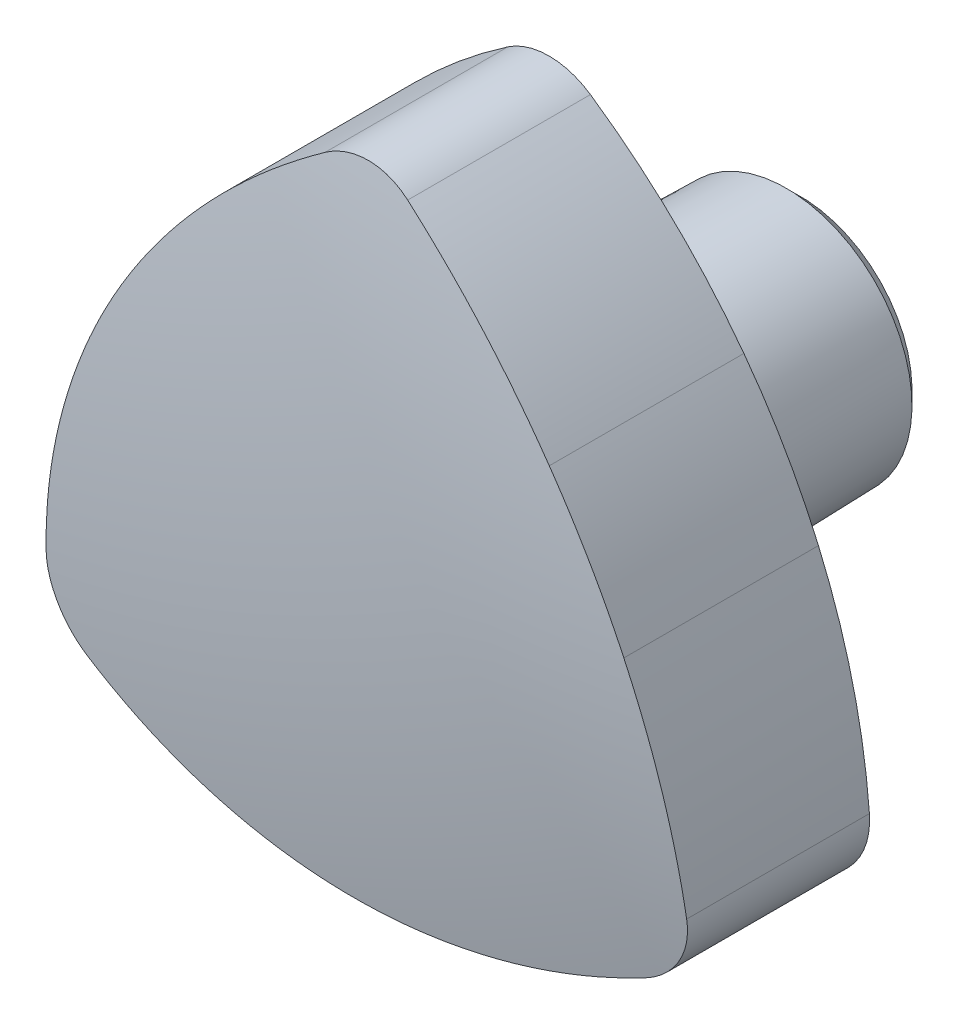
ISO-10303-21;
HEADER;
FILE_DESCRIPTION(('STEP AP214'),'2;1');
FILE_NAME('part.step','',(''),(''),'','','');
FILE_SCHEMA(('AUTOMOTIVE_DESIGN { 1 0 10303 214 1 1 1 1 }'));
ENDSEC;
DATA;
#1=APPLICATION_CONTEXT('core data for automotive mechanical design processes');
#2=APPLICATION_PROTOCOL_DEFINITION('international standard','automotive_design',2000,#1);
#3=PRODUCT_CONTEXT('',#1,'mechanical');
#4=PRODUCT('Part','Part','',(#3));
#5=PRODUCT_RELATED_PRODUCT_CATEGORY('part','',(#4));
#6=PRODUCT_DEFINITION_FORMATION('','',#4);
#7=PRODUCT_DEFINITION_CONTEXT('part definition',#1,'design');
#8=PRODUCT_DEFINITION('design','',#6,#7);
#9=PRODUCT_DEFINITION_SHAPE('','',#8);
#10=(LENGTH_UNIT() NAMED_UNIT(*) SI_UNIT(.MILLI.,.METRE.));
#11=(NAMED_UNIT(*) PLANE_ANGLE_UNIT() SI_UNIT($,.RADIAN.));
#12=(NAMED_UNIT(*) SI_UNIT($,.STERADIAN.) SOLID_ANGLE_UNIT());
#13=UNCERTAINTY_MEASURE_WITH_UNIT(LENGTH_MEASURE(1.E-05),#10,'distance_accuracy_value','');
#14=(GEOMETRIC_REPRESENTATION_CONTEXT(3) GLOBAL_UNCERTAINTY_ASSIGNED_CONTEXT((#13)) GLOBAL_UNIT_ASSIGNED_CONTEXT((#10,
#11,#12)) REPRESENTATION_CONTEXT('',''));
#15=CARTESIAN_POINT('',(0.,0.,0.));
#16=DIRECTION('',(0.,0.,1.));
#17=DIRECTION('',(1.,0.,0.));
#18=AXIS2_PLACEMENT_3D('',#15,#16,#17);
#19=CARTESIAN_POINT('',(3.,0.,12.));
#20=DIRECTION('',(0.,0.,1.));
#21=DIRECTION('',(0.,-1.,0.));
#22=AXIS2_PLACEMENT_3D('',#19,#20,#21);
#23=PLANE('',#22);
#24=CARTESIAN_POINT('',(0.,0.,12.));
#25=DIRECTION('',(0.,0.,1.));
#26=DIRECTION('',(0.,-1.,0.));
#27=AXIS2_PLACEMENT_3D('',#24,#25,#26);
#28=CIRCLE('',#27,3.);
#29=CARTESIAN_POINT('',(0.,-3.,12.));
#30=VERTEX_POINT('',#29);
#31=EDGE_CURVE('E110',#30,#30,#28,.T.);
#32=ORIENTED_EDGE('',*,*,#31,.F.);
#33=EDGE_LOOP('',(#32));
#34=FACE_BOUND('',#33,.T.);
#35=ADVANCED_FACE('F14',(#34),#23,.F.);
#36=CARTESIAN_POINT('',(0.,0.,33.0948745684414));
#37=DIRECTION('',(0.,0.,1.));
#38=DIRECTION('',(0.,-1.,0.));
#39=AXIS2_PLACEMENT_3D('',#36,#37,#38);
#40=CYLINDRICAL_SURFACE('',#39,3.);
#41=CARTESIAN_POINT('',(0.,0.,0.));
#42=DIRECTION('',(0.,0.,1.));
#43=DIRECTION('',(0.,-1.,0.));
#44=AXIS2_PLACEMENT_3D('',#41,#42,#43);
#45=CIRCLE('',#44,3.);
#46=CARTESIAN_POINT('',(0.,-3.,0.));
#47=VERTEX_POINT('',#46);
#48=EDGE_CURVE('E264',#47,#47,#45,.T.);
#49=ORIENTED_EDGE('',*,*,#48,.F.);
#50=EDGE_LOOP('',(#49));
#51=FACE_BOUND('',#50,.T.);
#52=ORIENTED_EDGE('',*,*,#31,.T.);
#53=EDGE_LOOP('',(#52));
#54=FACE_BOUND('',#53,.T.);
#55=ADVANCED_FACE('F253',(#51,#54),#40,.F.);
#56=CARTESIAN_POINT('',(6.2298324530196,0.,0.));
#57=DIRECTION('',(0.,0.,1.));
#58=DIRECTION('',(0.,-1.,0.));
#59=AXIS2_PLACEMENT_3D('',#56,#57,#58);
#60=PLANE('',#59);
#61=CARTESIAN_POINT('',(0.,0.,0.));
#62=DIRECTION('',(0.,0.,1.));
#63=DIRECTION('',(0.,-1.,0.));
#64=AXIS2_PLACEMENT_3D('',#61,#62,#63);
#65=CIRCLE('',#64,6.2298324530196);
#66=CARTESIAN_POINT('',(0.,-6.2298324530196,0.));
#67=VERTEX_POINT('',#66);
#68=EDGE_CURVE('E266',#67,#67,#65,.T.);
#69=ORIENTED_EDGE('',*,*,#68,.F.);
#70=EDGE_LOOP('',(#69));
#71=FACE_BOUND('',#70,.T.);
#72=ORIENTED_EDGE('',*,*,#48,.T.);
#73=EDGE_LOOP('',(#72));
#74=FACE_BOUND('',#73,.T.);
#75=ADVANCED_FACE('F259',(#71,#74),#60,.F.);
#76=CARTESIAN_POINT('',(0.,0.,0.));
#77=DIRECTION('',(0.,0.,1.));
#78=DIRECTION('',(0.,-1.,0.));
#79=AXIS2_PLACEMENT_3D('',#76,#77,#78);
#80=CONICAL_SURFACE('',#79,6.2298324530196,0.785398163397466);
#81=CARTESIAN_POINT('',(0.,0.,0.770167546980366));
#82=DIRECTION('',(0.,0.,1.));
#83=DIRECTION('',(0.,-1.,0.));
#84=AXIS2_PLACEMENT_3D('',#81,#82,#83);
#85=CIRCLE('',#84,7.);
#86=CARTESIAN_POINT('',(0.,-7.,0.770167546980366));
#87=VERTEX_POINT('',#86);
#88=EDGE_CURVE('E271',#87,#87,#85,.T.);
#89=ORIENTED_EDGE('',*,*,#88,.F.);
#90=EDGE_LOOP('',(#89));
#91=FACE_BOUND('',#90,.T.);
#92=ORIENTED_EDGE('',*,*,#68,.T.);
#93=EDGE_LOOP('',(#92));
#94=FACE_BOUND('',#93,.T.);
#95=ADVANCED_FACE('F436',(#91,#94),#80,.T.);
#96=CARTESIAN_POINT('',(0.,0.,0.770167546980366));
#97=DIRECTION('',(0.,0.,1.));
#98=DIRECTION('',(0.,-1.,0.));
#99=AXIS2_PLACEMENT_3D('',#96,#97,#98);
#100=CONICAL_SURFACE('',#99,7.,0.0261799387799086);
#101=CARTESIAN_POINT('',(0.,0.,11.1471451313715));
#102=DIRECTION('',(0.,0.,1.));
#103=DIRECTION('',(0.,-1.,0.));
#104=AXIS2_PLACEMENT_3D('',#101,#102,#103);
#105=CIRCLE('',#104,7.27173072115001);
#106=CARTESIAN_POINT('',(0.,-7.27173072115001,11.1471451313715));
#107=VERTEX_POINT('',#106);
#108=EDGE_CURVE('E274',#107,#107,#105,.T.);
#109=ORIENTED_EDGE('',*,*,#108,.F.);
#110=EDGE_LOOP('',(#109));
#111=FACE_BOUND('',#110,.T.);
#112=ORIENTED_EDGE('',*,*,#88,.T.);
#113=EDGE_LOOP('',(#112));
#114=FACE_BOUND('',#113,.T.);
#115=ADVANCED_FACE('F426',(#111,#114),#100,.T.);
#116=CARTESIAN_POINT('',(0.,0.,11.0882469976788));
#117=DIRECTION('',(0.,0.,1.));
#118=DIRECTION('',(0.,-1.,0.));
#119=AXIS2_PLACEMENT_3D('',#116,#117,#118);
#120=TOROIDAL_SURFACE('',#119,9.52095970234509,2.25000000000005);
#121=CARTESIAN_POINT('',(0.,0.,13.3189979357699));
#122=DIRECTION('',(0.,0.,1.));
#123=DIRECTION('',(0.,-1.,0.));
#124=AXIS2_PLACEMENT_3D('',#121,#122,#123);
#125=CIRCLE('',#124,9.22727576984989);
#126=CARTESIAN_POINT('',(0.,-9.22727576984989,13.3189979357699));
#127=VERTEX_POINT('',#126);
#128=EDGE_CURVE('E277',#127,#127,#125,.T.);
#129=ORIENTED_EDGE('',*,*,#128,.F.);
#130=EDGE_LOOP('',(#129));
#131=FACE_BOUND('',#130,.T.);
#132=ORIENTED_EDGE('',*,*,#108,.T.);
#133=EDGE_LOOP('',(#132));
#134=FACE_BOUND('',#133,.T.);
#135=ADVANCED_FACE('F415',(#131,#134),#120,.F.);
#136=CARTESIAN_POINT('',(0.,0.,13.3189979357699));
#137=DIRECTION('',(0.,0.,1.));
#138=DIRECTION('',(0.,-1.,0.));
#139=AXIS2_PLACEMENT_3D('',#136,#137,#138);
#140=CONICAL_SURFACE('',#139,9.22727576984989,1.43989663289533);
#141=CARTESIAN_POINT('',(0.,0.,14.));
#142=DIRECTION('',(0.,0.,1.));
#143=DIRECTION('',(0.,-1.,0.));
#144=AXIS2_PLACEMENT_3D('',#141,#142,#143);
#145=CIRCLE('',#144,14.4);
#146=CARTESIAN_POINT('',(0.,-14.4,14.));
#147=VERTEX_POINT('',#146);
#148=EDGE_CURVE('E280',#147,#147,#145,.T.);
#149=ORIENTED_EDGE('',*,*,#148,.F.);
#150=EDGE_LOOP('',(#149));
#151=FACE_BOUND('',#150,.T.);
#152=ORIENTED_EDGE('',*,*,#128,.T.);
#153=EDGE_LOOP('',(#152));
#154=FACE_BOUND('',#153,.T.);
#155=ADVANCED_FACE('F249',(#151,#154),#140,.T.);
#156=CARTESIAN_POINT('',(14.4,0.,14.));
#157=DIRECTION('',(0.,0.,1.));
#158=DIRECTION('',(0.,-1.,0.));
#159=AXIS2_PLACEMENT_3D('',#156,#157,#158);
#160=PLANE('',#159);
#161=CARTESIAN_POINT('',(17.9664252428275,-10.3729204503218,14.));
#162=DIRECTION('',(0.,0.,1.));
#163=DIRECTION('',(0.,-1.,0.));
#164=AXIS2_PLACEMENT_3D('',#161,#162,#163);
#165=CIRCLE('',#164,35.925661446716);
#166=CARTESIAN_POINT('',(-10.8589068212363,11.0689400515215,14.));
#167=VERTEX_POINT('',#166);
#168=CARTESIAN_POINT('',(-2.30380891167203,19.2880093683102,14.));
#169=VERTEX_POINT('',#168);
#170=EDGE_CURVE('E286',#167,#169,#165,.F.);
#171=ORIENTED_EDGE('',*,*,#170,.T.);
#172=CARTESIAN_POINT('',(0.,15.9168510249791,14.));
#173=DIRECTION('',(0.,0.,1.));
#174=DIRECTION('',(0.,-1.,0.));
#175=AXIS2_PLACEMENT_3D('',#172,#173,#174);
#176=CIRCLE('',#175,4.08316593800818);
#177=CARTESIAN_POINT('',(2.30380891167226,19.28800936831,14.));
#178=VERTEX_POINT('',#177);
#179=EDGE_CURVE('E283',#169,#178,#176,.F.);
#180=ORIENTED_EDGE('',*,*,#179,.T.);
#181=CARTESIAN_POINT('',(-17.9664252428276,-10.3729204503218,14.));
#182=DIRECTION('',(0.,0.,1.));
#183=DIRECTION('',(0.,-1.,0.));
#184=AXIS2_PLACEMENT_3D('',#181,#182,#183);
#185=CIRCLE('',#184,35.925661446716);
#186=CARTESIAN_POINT('',(10.8589068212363,11.0689400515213,14.));
#187=VERTEX_POINT('',#186);
#188=EDGE_CURVE('E314',#178,#187,#185,.F.);
#189=ORIENTED_EDGE('',*,*,#188,.T.);
#190=CARTESIAN_POINT('',(-17.888591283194,-10.3279829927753,14.));
#191=DIRECTION('',(0.,0.,1.));
#192=DIRECTION('',(0.,-1.,0.));
#193=AXIS2_PLACEMENT_3D('',#190,#191,#192);
#194=CIRCLE('',#193,35.8363916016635);
#195=CARTESIAN_POINT('',(15.0154366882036,3.86961913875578,14.));
#196=VERTEX_POINT('',#195);
#197=EDGE_CURVE('E117',#187,#196,#194,.F.);
#198=ORIENTED_EDGE('',*,*,#197,.T.);
#199=CARTESIAN_POINT('',(-17.9664252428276,-10.3729204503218,14.));
#200=DIRECTION('',(0.,0.,1.));
#201=DIRECTION('',(0.,-1.,0.));
#202=AXIS2_PLACEMENT_3D('',#199,#200,#201);
#203=CIRCLE('',#202,35.925661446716);
#204=CARTESIAN_POINT('',(17.8558105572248,-7.64884764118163,14.));
#205=VERTEX_POINT('',#204);
#206=EDGE_CURVE('E310',#196,#205,#203,.F.);
#207=ORIENTED_EDGE('',*,*,#206,.T.);
#208=CARTESIAN_POINT('',(13.7843973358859,-7.9584255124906,14.));
#209=DIRECTION('',(0.,0.,1.));
#210=DIRECTION('',(0.,-1.,0.));
#211=AXIS2_PLACEMENT_3D('',#208,#209,#210);
#212=CIRCLE('',#211,4.08316593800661);
#213=CARTESIAN_POINT('',(15.5520016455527,-11.6391617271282,14.));
#214=VERTEX_POINT('',#213);
#215=EDGE_CURVE('E307',#205,#214,#212,.F.);
#216=ORIENTED_EDGE('',*,*,#215,.T.);
#217=CARTESIAN_POINT('',(0.,20.7458409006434,14.));
#218=DIRECTION('',(0.,0.,1.));
#219=DIRECTION('',(0.,-1.,0.));
#220=AXIS2_PLACEMENT_3D('',#217,#218,#219);
#221=CIRCLE('',#220,35.9256614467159);
#222=CARTESIAN_POINT('',(4.15652986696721,-14.9385591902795,14.));
#223=VERTEX_POINT('',#222);
#224=EDGE_CURVE('E304',#214,#223,#221,.F.);
#225=ORIENTED_EDGE('',*,*,#224,.T.);
#226=CARTESIAN_POINT('',(0.,20.6559659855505,14.));
#227=DIRECTION('',(0.,0.,1.));
#228=DIRECTION('',(0.,-1.,0.));
#229=AXIS2_PLACEMENT_3D('',#226,#227,#228);
#230=CIRCLE('',#229,35.8363916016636);
#231=CARTESIAN_POINT('',(-4.15652986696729,-14.9385591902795,14.));
#232=VERTEX_POINT('',#231);
#233=EDGE_CURVE('E301',#223,#232,#230,.F.);
#234=ORIENTED_EDGE('',*,*,#233,.T.);
#235=CARTESIAN_POINT('',(0.,20.7458409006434,14.));
#236=DIRECTION('',(0.,0.,1.));
#237=DIRECTION('',(0.,-1.,0.));
#238=AXIS2_PLACEMENT_3D('',#235,#236,#237);
#239=CIRCLE('',#238,35.925661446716);
#240=CARTESIAN_POINT('',(-15.5520016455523,-11.6391617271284,14.));
#241=VERTEX_POINT('',#240);
#242=EDGE_CURVE('E298',#232,#241,#239,.F.);
#243=ORIENTED_EDGE('',*,*,#242,.T.);
#244=CARTESIAN_POINT('',(-13.7843973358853,-7.95842551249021,14.));
#245=DIRECTION('',(0.,0.,1.));
#246=DIRECTION('',(0.,-1.,0.));
#247=AXIS2_PLACEMENT_3D('',#244,#245,#246);
#248=CIRCLE('',#247,4.08316593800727);
#249=CARTESIAN_POINT('',(-17.8558105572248,-7.64884764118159,14.));
#250=VERTEX_POINT('',#249);
#251=EDGE_CURVE('E295',#241,#250,#248,.F.);
#252=ORIENTED_EDGE('',*,*,#251,.T.);
#253=CARTESIAN_POINT('',(17.9664252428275,-10.3729204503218,14.));
#254=DIRECTION('',(0.,0.,1.));
#255=DIRECTION('',(0.,-1.,0.));
#256=AXIS2_PLACEMENT_3D('',#253,#254,#255);
#257=CIRCLE('',#256,35.9256614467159);
#258=CARTESIAN_POINT('',(-15.0154366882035,3.86961913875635,14.));
#259=VERTEX_POINT('',#258);
#260=EDGE_CURVE('E292',#250,#259,#257,.F.);
#261=ORIENTED_EDGE('',*,*,#260,.T.);
#262=CARTESIAN_POINT('',(17.8885912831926,-10.3279829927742,14.));
#263=DIRECTION('',(0.,0.,1.));
#264=DIRECTION('',(0.,-1.,0.));
#265=AXIS2_PLACEMENT_3D('',#262,#263,#264);
#266=CIRCLE('',#265,35.8363916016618);
#267=EDGE_CURVE('E289',#259,#167,#266,.F.);
#268=ORIENTED_EDGE('',*,*,#267,.T.);
#269=EDGE_LOOP('',(#171,#180,#189,#198,#207,#216,#225,#234,#243,#252,#261,#268));
#270=FACE_BOUND('',#269,.T.);
#271=ORIENTED_EDGE('',*,*,#148,.T.);
#272=EDGE_LOOP('',(#271));
#273=FACE_BOUND('',#272,.T.);
#274=ADVANCED_FACE('F242',(#270,#273),#160,.F.);
#275=CARTESIAN_POINT('',(0.,15.9168510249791,26.));
#276=DIRECTION('',(0.,0.,-1.));
#277=DIRECTION('',(0.,1.,0.));
#278=AXIS2_PLACEMENT_3D('',#275,#276,#277);
#279=CYLINDRICAL_SURFACE('',#278,4.08316593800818);
#280=DIRECTION('',(0.,0.,-1.));
#281=VECTOR('',#280,1.);
#282=CARTESIAN_POINT('',(-2.30380891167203,19.2880093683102,26.));
#283=LINE('',#282,#281);
#284=CARTESIAN_POINT('',(-2.30380891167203,19.2880093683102,24.1875242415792));
#285=VERTEX_POINT('',#284);
#286=EDGE_CURVE('E316',#285,#169,#283,.T.);
#287=ORIENTED_EDGE('',*,*,#286,.F.);
#288=CARTESIAN_POINT('',(2.30400891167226,19.2878726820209,24.1875453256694));
#289=CARTESIAN_POINT('',(2.21025422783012,19.3519667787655,24.177658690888));
#290=CARTESIAN_POINT('',(2.11376853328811,19.4121585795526,24.1683725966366));
#291=CARTESIAN_POINT('',(1.91603240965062,19.524337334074,24.1510641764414));
#292=CARTESIAN_POINT('',(1.81478200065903,19.5763243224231,24.143041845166));
#293=CARTESIAN_POINT('',(1.60826226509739,19.6716709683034,24.1283270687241));
#294=CARTESIAN_POINT('',(1.50299488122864,19.7150347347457,24.121633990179));
#295=CARTESIAN_POINT('',(1.28914029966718,19.7928420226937,24.109623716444));
#296=CARTESIAN_POINT('',(1.18055318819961,19.8272857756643,24.1043064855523));
#297=CARTESIAN_POINT('',(0.960775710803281,19.8870055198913,24.0950867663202));
#298=CARTESIAN_POINT('',(0.849584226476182,19.9122774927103,24.091184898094));
#299=CARTESIAN_POINT('',(0.6253972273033,19.9534483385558,24.0848280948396));
#300=CARTESIAN_POINT('',(0.512401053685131,19.9693437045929,24.0823737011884));
#301=CARTESIAN_POINT('',(0.285509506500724,19.9916158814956,24.0789346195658));
#302=CARTESIAN_POINT('',(0.171614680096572,19.9979980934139,24.0779490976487));
#303=CARTESIAN_POINT('',(-0.0563245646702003,20.0012219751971,24.0774512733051));
#304=CARTESIAN_POINT('',(-0.17036902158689,19.9980602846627,24.0779394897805));
#305=CARTESIAN_POINT('',(-0.510519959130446,19.9743162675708,24.0816059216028));
#306=CARTESIAN_POINT('',(-0.735777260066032,19.9395847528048,24.0869689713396));
#307=CARTESIAN_POINT('',(-1.17706332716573,19.8332619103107,24.1033841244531));
#308=CARTESIAN_POINT('',(-1.39309602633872,19.7616864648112,24.1144337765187));
#309=CARTESIAN_POINT('',(-1.72472161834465,19.6203059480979,24.1362545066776));
#310=CARTESIAN_POINT('',(-1.84532015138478,19.5617023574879,24.1452984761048));
#311=CARTESIAN_POINT('',(-2.07984854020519,19.4331467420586,24.1651345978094));
#312=CARTESIAN_POINT('',(-2.19379099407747,19.3632171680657,24.1759232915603));
#313=CARTESIAN_POINT('',(-2.30400891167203,19.2878726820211,24.1875453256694));
#314=B_SPLINE_CURVE_WITH_KNOTS('',3,(#288,#289,#290,#291,#292,#293,#294,#295,#296,#297,#298,
#299,#300,#301,#302,#303,#304,#305,#306,#307,#308,#309,#310,#311,#312,#313),.UNSPECIFIED.,.F.,
.F.,(4,2,2,2,2,2,2,2,2,2,2,2,4),(0.,0.341896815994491,0.683792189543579,1.02552425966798,
1.36724746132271,1.70912020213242,2.05112072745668,2.39292700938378,2.73485365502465,
3.41533460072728,4.09552245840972,4.49808490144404,4.89985892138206),.UNSPECIFIED.);
#315=CARTESIAN_POINT('',(2.30380891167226,19.28800936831,24.1875242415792));
#316=VERTEX_POINT('',#315);
#317=EDGE_CURVE('E9',#316,#285,#314,.T.);
#318=ORIENTED_EDGE('',*,*,#317,.F.);
#319=DIRECTION('',(0.,0.,-1.));
#320=VECTOR('',#319,1.);
#321=CARTESIAN_POINT('',(2.30380891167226,19.28800936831,26.));
#322=LINE('',#321,#320);
#323=EDGE_CURVE('E39',#316,#178,#322,.T.);
#324=ORIENTED_EDGE('',*,*,#323,.T.);
#325=ORIENTED_EDGE('',*,*,#179,.F.);
#326=EDGE_LOOP('',(#287,#318,#324,#325));
#327=FACE_BOUND('',#326,.T.);
#328=ADVANCED_FACE('F238',(#327),#279,.T.);
#329=CARTESIAN_POINT('',(17.9664252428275,-10.3729204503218,26.));
#330=DIRECTION('',(0.,0.,-1.));
#331=DIRECTION('',(0.,1.,0.));
#332=AXIS2_PLACEMENT_3D('',#329,#330,#331);
#333=CYLINDRICAL_SURFACE('',#332,35.925661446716);
#334=DIRECTION('',(0.,0.,-1.));
#335=VECTOR('',#334,1.);
#336=CARTESIAN_POINT('',(-10.8589068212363,11.0689400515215,26.));
#337=LINE('',#336,#335);
#338=CARTESIAN_POINT('',(-10.8589068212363,11.0689400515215,24.8487491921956));
#339=VERTEX_POINT('',#338);
#340=EDGE_CURVE('E319',#339,#167,#337,.T.);
#341=ORIENTED_EDGE('',*,*,#340,.F.);
#342=CARTESIAN_POINT('',(-2.30360891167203,19.2881460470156,24.1875031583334));
#343=CARTESIAN_POINT('',(-2.71424957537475,19.0075202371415,24.2307915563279));
#344=CARTESIAN_POINT('',(-3.11915213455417,18.7183014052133,24.2721900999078));
#345=CARTESIAN_POINT('',(-3.91683632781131,18.1231087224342,24.3511516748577));
#346=CARTESIAN_POINT('',(-4.3096179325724,17.8171348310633,24.3887146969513));
#347=CARTESIAN_POINT('',(-5.46318562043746,16.8793027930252,24.4950479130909));
#348=CARTESIAN_POINT('',(-6.20519067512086,16.2234342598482,24.5580937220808));
#349=CARTESIAN_POINT('',(-7.63311155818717,14.8520038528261,24.66839719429));
#350=CARTESIAN_POINT('',(-8.31902689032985,14.1364414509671,24.7156547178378));
#351=CARTESIAN_POINT('',(-9.30430172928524,13.0195922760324,24.7746096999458));
#352=CARTESIAN_POINT('',(-9.62654836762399,12.6385970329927,24.7923150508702));
#353=CARTESIAN_POINT('',(-10.254977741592,11.8634124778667,24.8236199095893));
#354=CARTESIAN_POINT('',(-10.5611603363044,11.4692230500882,24.8372193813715));
#355=CARTESIAN_POINT('',(-10.8590555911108,11.0687400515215,24.8487549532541));
#356=B_SPLINE_CURVE_WITH_KNOTS('',3,(#342,#343,#344,#345,#346,#347,#348,#349,#350,#351,#352,
#353,#354,#355),.UNSPECIFIED.,.F.,.F.,(4,2,2,2,2,2,4),(0.,1.49753176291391,2.99506714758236,
5.96833487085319,8.94162889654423,10.4391741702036,11.9367325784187),.UNSPECIFIED.);
#357=EDGE_CURVE('E27',#285,#339,#356,.T.);
#358=ORIENTED_EDGE('',*,*,#357,.F.);
#359=ORIENTED_EDGE('',*,*,#286,.T.);
#360=ORIENTED_EDGE('',*,*,#170,.F.);
#361=EDGE_LOOP('',(#341,#358,#359,#360));
#362=FACE_BOUND('',#361,.T.);
#363=ADVANCED_FACE('F234',(#362),#333,.T.);
#364=CARTESIAN_POINT('',(17.8885912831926,-10.3279829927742,26.));
#365=DIRECTION('',(0.,0.,-1.));
#366=DIRECTION('',(0.,1.,0.));
#367=AXIS2_PLACEMENT_3D('',#364,#365,#366);
#368=CYLINDRICAL_SURFACE('',#367,35.8363916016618);
#369=DIRECTION('',(0.,0.,-1.));
#370=VECTOR('',#369,1.);
#371=CARTESIAN_POINT('',(-15.0154366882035,3.86961913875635,26.));
#372=LINE('',#371,#370);
#373=CARTESIAN_POINT('',(-15.0154366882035,3.86961913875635,24.8487491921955));
#374=VERTEX_POINT('',#373);
#375=EDGE_CURVE('E322',#374,#259,#372,.T.);
#376=ORIENTED_EDGE('',*,*,#375,.F.);
#377=CARTESIAN_POINT('',(-10.8587579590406,11.0691400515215,24.8487434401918));
#378=CARTESIAN_POINT('',(-11.2740180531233,10.511276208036,24.8647928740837));
#379=CARTESIAN_POINT('',(-11.673050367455,9.94122078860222,24.8768326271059));
#380=CARTESIAN_POINT('',(-12.4359952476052,8.78082149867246,24.8928452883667));
#381=CARTESIAN_POINT('',(-12.8000258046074,8.19055559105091,24.8968462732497));
#382=CARTESIAN_POINT('',(-13.4932268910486,6.98989730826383,24.896846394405));
#383=CARTESIAN_POINT('',(-13.8223974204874,6.3795049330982,24.8928455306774));
#384=CARTESIAN_POINT('',(-14.4458613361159,5.13857618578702,24.8768331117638));
#385=CARTESIAN_POINT('',(-14.740028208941,4.50797661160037,24.8647934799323));
#386=CARTESIAN_POINT('',(-15.0155229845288,3.86941913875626,24.8487441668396));
#387=B_SPLINE_CURVE_WITH_KNOTS('',3,(#377,#378,#379,#380,#381,#382,#383,#384,#385,#386),
.UNSPECIFIED.,.F.,.F.,(4,2,2,2,4),(0.,2.08660045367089,4.16590037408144,6.2452002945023,
8.33180074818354),.UNSPECIFIED.);
#388=EDGE_CURVE('E220',#339,#374,#387,.T.);
#389=ORIENTED_EDGE('',*,*,#388,.F.);
#390=ORIENTED_EDGE('',*,*,#340,.T.);
#391=ORIENTED_EDGE('',*,*,#267,.F.);
#392=EDGE_LOOP('',(#376,#389,#390,#391));
#393=FACE_BOUND('',#392,.T.);
#394=ADVANCED_FACE('F231',(#393),#368,.T.);
#395=CARTESIAN_POINT('',(17.9664252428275,-10.3729204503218,26.));
#396=DIRECTION('',(0.,0.,-1.));
#397=DIRECTION('',(0.,1.,0.));
#398=AXIS2_PLACEMENT_3D('',#395,#396,#397);
#399=CYLINDRICAL_SURFACE('',#398,35.9256614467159);
#400=DIRECTION('',(0.,0.,-1.));
#401=VECTOR('',#400,1.);
#402=CARTESIAN_POINT('',(-17.8558105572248,-7.64884764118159,26.));
#403=LINE('',#402,#401);
#404=CARTESIAN_POINT('',(-17.8558105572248,-7.64884764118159,24.1875242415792));
#405=VERTEX_POINT('',#404);
#406=EDGE_CURVE('E325',#405,#250,#403,.T.);
#407=ORIENTED_EDGE('',*,*,#406,.F.);
#408=CARTESIAN_POINT('',(-15.0153503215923,3.86981913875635,24.8487542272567));
#409=CARTESIAN_POINT('',(-15.2132295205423,3.41159544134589,24.8372186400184));
#410=CARTESIAN_POINT('',(-15.4015147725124,2.94934154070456,24.8236191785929));
#411=CARTESIAN_POINT('',(-15.7586268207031,2.01751900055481,24.7923143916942));
#412=CARTESIAN_POINT('',(-15.9274537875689,1.5479504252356,24.7746091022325));
#413=CARTESIAN_POINT('',(-16.4020327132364,0.136261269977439,24.7156543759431));
#414=CARTESIAN_POINT('',(-16.6787684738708,-0.815534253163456,24.6683971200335));
#415=CARTESIAN_POINT('',(-17.1524989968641,-2.73785343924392,24.5580943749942));
#416=CARTESIAN_POINT('',(-17.3494944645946,-3.70837693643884,24.4950490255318));
#417=CARTESIAN_POINT('',(-17.5848965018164,-5.17630275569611,24.388716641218));
#418=CARTESIAN_POINT('',(-17.6534868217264,-5.6694454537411,24.3511539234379));
#419=CARTESIAN_POINT('',(-17.7700968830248,-6.65785037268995,24.272193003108));
#420=CARTESIAN_POINT('',(-17.8181166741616,-7.15311258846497,24.2307948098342));
#421=CARTESIAN_POINT('',(-17.8558257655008,-7.64904764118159,24.1875067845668));
#422=B_SPLINE_CURVE_WITH_KNOTS('',3,(#408,#409,#410,#411,#412,#413,#414,#415,#416,#417,#418,
#419,#420,#421),.UNSPECIFIED.,.F.,.F.,(4,2,2,2,2,2,4),(0.,1.49754915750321,2.99508518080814,
5.96836110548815,8.94161072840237,10.4391368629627,11.936659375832),.UNSPECIFIED.);
#423=EDGE_CURVE('E213',#374,#405,#422,.T.);
#424=ORIENTED_EDGE('',*,*,#423,.F.);
#425=ORIENTED_EDGE('',*,*,#375,.T.);
#426=ORIENTED_EDGE('',*,*,#260,.F.);
#427=EDGE_LOOP('',(#407,#424,#425,#426));
#428=FACE_BOUND('',#427,.T.);
#429=ADVANCED_FACE('F202',(#428),#399,.T.);
#430=CARTESIAN_POINT('',(-13.7843973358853,-7.95842551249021,26.));
#431=DIRECTION('',(0.,0.,-1.));
#432=DIRECTION('',(0.,1.,0.));
#433=AXIS2_PLACEMENT_3D('',#430,#431,#432);
#434=CYLINDRICAL_SURFACE('',#433,4.08316593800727);
#435=DIRECTION('',(0.,0.,-1.));
#436=VECTOR('',#435,1.);
#437=CARTESIAN_POINT('',(-15.5520016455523,-11.6391617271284,26.));
#438=LINE('',#437,#436);
#439=CARTESIAN_POINT('',(-15.5520016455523,-11.6391617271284,24.1875242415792));
#440=VERTEX_POINT('',#439);
#441=EDGE_CURVE('E328',#440,#241,#438,.T.);
#442=ORIENTED_EDGE('',*,*,#441,.F.);
#443=CARTESIAN_POINT('',(-17.8557953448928,-7.64864764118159,24.1875416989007));
#444=CARTESIAN_POINT('',(-17.864423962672,-7.76188870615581,24.1776552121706));
#445=CARTESIAN_POINT('',(-17.8683075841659,-7.87554369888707,24.1683692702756));
#446=CARTESIAN_POINT('',(-17.8665868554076,-8.10287754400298,24.1510611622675));
#447=CARTESIAN_POINT('',(-17.8609825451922,-8.21655639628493,24.1430389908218));
#448=CARTESIAN_POINT('',(-17.8402929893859,-8.44308081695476,24.1283245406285));
#449=CARTESIAN_POINT('',(-17.8252122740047,-8.5559267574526,24.1216316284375));
#450=CARTESIAN_POINT('',(-17.7856657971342,-8.78003346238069,24.1096216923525));
#451=CARTESIAN_POINT('',(-17.761200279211,-8.89129426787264,24.1043046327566));
#452=CARTESIAN_POINT('',(-17.7030281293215,-9.1114863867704,24.0950852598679));
#453=CARTESIAN_POINT('',(-17.6693174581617,-9.22041665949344,24.0911835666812));
#454=CARTESIAN_POINT('',(-17.5928767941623,-9.43515289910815,24.0848271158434));
#455=CARTESIAN_POINT('',(-17.5501434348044,-9.540957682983,24.0823728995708));
#456=CARTESIAN_POINT('',(-17.4559838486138,-9.7485866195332,24.0789341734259));
#457=CARTESIAN_POINT('',(-17.4045625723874,-9.8504129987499,24.0779488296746));
#458=CARTESIAN_POINT('',(-17.2933829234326,-10.0494249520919,24.0774513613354));
#459=CARTESIAN_POINT('',(-17.2336216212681,-10.1466088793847,24.0779397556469));
#460=CARTESIAN_POINT('',(-17.0429803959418,-10.4293142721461,24.0816067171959));
#461=CARTESIAN_POINT('',(-16.900271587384,-10.6070256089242,24.0869701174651));
#462=CARTESIAN_POINT('',(-16.5875469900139,-10.9360259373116,24.1033859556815));
#463=CARTESIAN_POINT('',(-16.41754299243,-11.0873262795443,24.11443594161));
#464=CARTESIAN_POINT('',(-16.1292971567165,-11.3038231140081,24.1362565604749));
#465=CARTESIAN_POINT('',(-16.0182537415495,-11.3789562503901,24.1452999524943));
#466=CARTESIAN_POINT('',(-15.7896742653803,-11.5177747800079,24.1651346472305));
#467=CARTESIAN_POINT('',(-15.6721513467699,-11.5814823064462,24.1759224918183));
#468=CARTESIAN_POINT('',(-15.5518016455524,-11.6392577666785,24.1875435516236));
#469=B_SPLINE_CURVE_WITH_KNOTS('',3,(#443,#444,#445,#446,#447,#448,#449,#450,#451,#452,#453,
#454,#455,#456,#457,#458,#459,#460,#461,#462,#463,#464,#465,#466,#467,#468),.UNSPECIFIED.,.F.,
.F.,(4,2,2,2,2,2,2,2,2,2,2,2,4),(0.,0.341896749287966,0.68379205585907,1.02552404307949,
1.36724716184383,1.70911981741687,2.05112025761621,2.39292647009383,2.73485304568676,
3.41533398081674,4.09552174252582,4.49805342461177,4.89979671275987),.UNSPECIFIED.);
#470=EDGE_CURVE('E206',#405,#440,#469,.T.);
#471=ORIENTED_EDGE('',*,*,#470,.F.);
#472=ORIENTED_EDGE('',*,*,#406,.T.);
#473=ORIENTED_EDGE('',*,*,#251,.F.);
#474=EDGE_LOOP('',(#442,#471,#472,#473));
#475=FACE_BOUND('',#474,.T.);
#476=ADVANCED_FACE('F197',(#475),#434,.T.);
#477=CARTESIAN_POINT('',(0.,20.7458409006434,26.));
#478=DIRECTION('',(0.,0.,-1.));
#479=DIRECTION('',(0.,1.,0.));
#480=AXIS2_PLACEMENT_3D('',#477,#478,#479);
#481=CYLINDRICAL_SURFACE('',#480,35.925661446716);
#482=DIRECTION('',(0.,0.,-1.));
#483=VECTOR('',#482,1.);
#484=CARTESIAN_POINT('',(-4.15652986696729,-14.9385591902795,26.));
#485=LINE('',#484,#483);
#486=CARTESIAN_POINT('',(-4.15652986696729,-14.9385591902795,24.8487491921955));
#487=VERTEX_POINT('',#486);
#488=EDGE_CURVE('E331',#487,#232,#485,.T.);
#489=ORIENTED_EDGE('',*,*,#488,.F.);
#490=CARTESIAN_POINT('',(-15.5522016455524,-11.639065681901,24.1875049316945));
#491=CARTESIAN_POINT('',(-15.1038546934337,-11.8543765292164,24.2307930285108));
#492=CARTESIAN_POINT('',(-14.6509350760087,-12.0604216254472,24.2721912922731));
#493=CARTESIAN_POINT('',(-13.7366461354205,-12.4536374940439,24.3511523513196));
#494=CARTESIAN_POINT('',(-13.2752767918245,-12.6408082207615,24.3887151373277));
#495=CARTESIAN_POINT('',(-11.8863144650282,-13.1709079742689,24.4950477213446));
#496=CARTESIAN_POINT('',(-10.9473185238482,-13.485567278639,24.558093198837));
#497=CARTESIAN_POINT('',(-9.04567554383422,-14.0364654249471,24.6683961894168));
#498=CARTESIAN_POINT('',(-8.08302829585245,-14.2727035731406,24.7156535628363));
#499=CARTESIAN_POINT('',(-6.62317971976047,-14.5675515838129,24.774608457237));
#500=CARTESIAN_POINT('',(-6.13210776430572,-14.6561277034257,24.7923138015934));
#501=CARTESIAN_POINT('',(-5.146569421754,-14.8127714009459,24.8236186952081));
#502=CARTESIAN_POINT('',(-4.65210300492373,-14.8808387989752,24.837218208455));
#503=CARTESIAN_POINT('',(-4.15632986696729,-14.9385824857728,24.8487538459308));
#504=B_SPLINE_CURVE_WITH_KNOTS('',3,(#490,#491,#492,#493,#494,#495,#496,#497,#498,#499,#500,
#501,#502,#503),.UNSPECIFIED.,.F.,.F.,(4,2,2,2,2,2,4),(0.,1.49752312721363,2.99504987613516,
5.9683007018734,8.94157782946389,10.4391144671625,11.936664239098),.UNSPECIFIED.);
#505=EDGE_CURVE('E182',#440,#487,#504,.T.);
#506=ORIENTED_EDGE('',*,*,#505,.F.);
#507=ORIENTED_EDGE('',*,*,#441,.T.);
#508=ORIENTED_EDGE('',*,*,#242,.F.);
#509=EDGE_LOOP('',(#489,#506,#507,#508));
#510=FACE_BOUND('',#509,.T.);
#511=ADVANCED_FACE('F192',(#510),#481,.T.);
#512=CARTESIAN_POINT('',(0.,20.6559659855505,26.));
#513=DIRECTION('',(0.,0.,-1.));
#514=DIRECTION('',(0.,1.,0.));
#515=AXIS2_PLACEMENT_3D('',#512,#513,#514);
#516=CYLINDRICAL_SURFACE('',#515,35.8363916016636);
#517=DIRECTION('',(0.,0.,-1.));
#518=VECTOR('',#517,1.);
#519=CARTESIAN_POINT('',(4.15652986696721,-14.9385591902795,26.));
#520=LINE('',#519,#518);
#521=CARTESIAN_POINT('',(4.15652986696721,-14.9385591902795,24.8487491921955));
#522=VERTEX_POINT('',#521);
#523=EDGE_CURVE('E334',#522,#223,#520,.T.);
#524=ORIENTED_EDGE('',*,*,#523,.F.);
#525=CARTESIAN_POINT('',(-4.15672986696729,-14.9385358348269,24.8487445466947));
#526=CARTESIAN_POINT('',(-3.4659808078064,-15.0192281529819,24.8647936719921));
#527=CARTESIAN_POINT('',(-2.77278749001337,-15.0797713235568,24.87683317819));
#528=CARTESIAN_POINT('',(-1.38639043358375,-15.1602994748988,24.8928454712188));
#529=CARTESIAN_POINT('',(-0.693195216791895,-15.1804256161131,24.896846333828));
#530=CARTESIAN_POINT('',(0.693195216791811,-15.1804256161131,24.896846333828));
#531=CARTESIAN_POINT('',(1.38639043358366,-15.1602994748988,24.8928454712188));
#532=CARTESIAN_POINT('',(2.77278749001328,-15.0797713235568,24.87683317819));
#533=CARTESIAN_POINT('',(3.46598080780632,-15.0192281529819,24.8647936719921));
#534=CARTESIAN_POINT('',(4.1567298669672,-14.9385358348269,24.8487445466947));
#535=B_SPLINE_CURVE_WITH_KNOTS('',3,(#525,#526,#527,#528,#529,#530,#531,#532,#533,#534),
.UNSPECIFIED.,.F.,.F.,(4,2,2,2,4),(0.,2.086584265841,4.16586816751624,6.24515206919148,
8.33173633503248),.UNSPECIFIED.);
#536=EDGE_CURVE('E175',#487,#522,#535,.T.);
#537=ORIENTED_EDGE('',*,*,#536,.F.);
#538=ORIENTED_EDGE('',*,*,#488,.T.);
#539=ORIENTED_EDGE('',*,*,#233,.F.);
#540=EDGE_LOOP('',(#524,#537,#538,#539));
#541=FACE_BOUND('',#540,.T.);
#542=ADVANCED_FACE('F189',(#541),#516,.T.);
#543=CARTESIAN_POINT('',(0.,20.7458409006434,26.));
#544=DIRECTION('',(0.,0.,-1.));
#545=DIRECTION('',(0.,1.,0.));
#546=AXIS2_PLACEMENT_3D('',#543,#544,#545);
#547=CYLINDRICAL_SURFACE('',#546,35.9256614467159);
#548=DIRECTION('',(0.,0.,-1.));
#549=VECTOR('',#548,1.);
#550=CARTESIAN_POINT('',(15.5520016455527,-11.6391617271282,26.));
#551=LINE('',#550,#549);
#552=CARTESIAN_POINT('',(15.5520016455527,-11.6391617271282,24.1875242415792));
#553=VERTEX_POINT('',#552);
#554=EDGE_CURVE('E337',#553,#214,#551,.T.);
#555=ORIENTED_EDGE('',*,*,#554,.F.);
#556=CARTESIAN_POINT('',(4.15632986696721,-14.9385824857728,24.8487538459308));
#557=CARTESIAN_POINT('',(4.65210300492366,-14.8808387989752,24.837218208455));
#558=CARTESIAN_POINT('',(5.14656942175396,-14.8127714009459,24.8236186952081));
#559=CARTESIAN_POINT('',(6.13210776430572,-14.6561277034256,24.7923138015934));
#560=CARTESIAN_POINT('',(6.6231797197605,-14.5675515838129,24.774608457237));
#561=CARTESIAN_POINT('',(8.08302829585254,-14.2727035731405,24.7156535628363));
#562=CARTESIAN_POINT('',(9.04567554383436,-14.036465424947,24.6683961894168));
#563=CARTESIAN_POINT('',(10.9473185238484,-13.4855672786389,24.558093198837));
#564=CARTESIAN_POINT('',(11.8863144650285,-13.1709079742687,24.4950477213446));
#565=CARTESIAN_POINT('',(13.2752767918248,-12.6408082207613,24.3887151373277));
#566=CARTESIAN_POINT('',(13.7366461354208,-12.4536374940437,24.3511523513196));
#567=CARTESIAN_POINT('',(14.6509350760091,-12.060421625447,24.272191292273));
#568=CARTESIAN_POINT('',(15.103854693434,-11.8543765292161,24.2307930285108));
#569=CARTESIAN_POINT('',(15.5522016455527,-11.6390656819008,24.1875049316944));
#570=B_SPLINE_CURVE_WITH_KNOTS('',3,(#556,#557,#558,#559,#560,#561,#562,#563,#564,#565,#566,
#567,#568,#569),.UNSPECIFIED.,.F.,.F.,(4,2,2,2,2,2,4),(0.,1.49754977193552,2.9950864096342,
5.96836353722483,8.9416143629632,10.4391411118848,11.9366642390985),.UNSPECIFIED.);
#571=EDGE_CURVE('E168',#522,#553,#570,.T.);
#572=ORIENTED_EDGE('',*,*,#571,.F.);
#573=ORIENTED_EDGE('',*,*,#523,.T.);
#574=ORIENTED_EDGE('',*,*,#224,.F.);
#575=EDGE_LOOP('',(#555,#572,#573,#574));
#576=FACE_BOUND('',#575,.T.);
#577=ADVANCED_FACE('F159',(#576),#547,.T.);
#578=CARTESIAN_POINT('',(13.7843973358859,-7.9584255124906,26.));
#579=DIRECTION('',(0.,0.,-1.));
#580=DIRECTION('',(0.,1.,0.));
#581=AXIS2_PLACEMENT_3D('',#578,#579,#580);
#582=CYLINDRICAL_SURFACE('',#581,4.08316593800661);
#583=DIRECTION('',(0.,0.,-1.));
#584=VECTOR('',#583,1.);
#585=CARTESIAN_POINT('',(17.8558105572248,-7.64884764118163,26.));
#586=LINE('',#585,#584);
#587=CARTESIAN_POINT('',(17.8558105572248,-7.64884764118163,24.1875242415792));
#588=VERTEX_POINT('',#587);
#589=EDGE_CURVE('E340',#588,#205,#586,.T.);
#590=ORIENTED_EDGE('',*,*,#589,.F.);
#591=CARTESIAN_POINT('',(15.5518016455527,-11.6392577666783,24.1875435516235));
#592=CARTESIAN_POINT('',(15.6541858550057,-11.5901103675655,24.1776569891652));
#593=CARTESIAN_POINT('',(15.7545560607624,-11.5366467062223,24.1683709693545));
#594=CARTESIAN_POINT('',(15.9505731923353,-11.4214906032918,24.1510627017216));
#595=CARTESIAN_POINT('',(16.0462201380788,-11.3597981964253,24.1430404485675));
#596=CARTESIAN_POINT('',(16.2320519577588,-11.228619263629,24.1283258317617));
#597=CARTESIAN_POINT('',(16.3222394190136,-11.1591364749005,24.1216328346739));
#598=CARTESIAN_POINT('',(16.4965490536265,-11.0128357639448,24.1096227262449));
#599=CARTESIAN_POINT('',(16.5806713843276,-10.9360180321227,24.1043055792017));
#600=CARTESIAN_POINT('',(16.7422781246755,-10.7755442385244,24.0950860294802));
#601=CARTESIAN_POINT('',(16.8197596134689,-10.691885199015,24.09118424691));
#602=CARTESIAN_POINT('',(16.9675072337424,-10.5183182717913,24.0848276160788));
#603=CARTESIAN_POINT('',(17.0377706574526,-10.4284080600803,24.0823733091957));
#604=CARTESIAN_POINT('',(17.1705037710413,-10.2430496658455,24.0789344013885));
#605=CARTESIAN_POINT('',(17.2329778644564,-10.1476046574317,24.0779489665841));
#606=CARTESIAN_POINT('',(17.3497384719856,-9.95181486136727,24.0774513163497));
#607=CARTESIAN_POINT('',(17.4040220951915,-9.85146836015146,24.077939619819));
#608=CARTESIAN_POINT('',(17.5535331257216,-9.54501626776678,24.0816063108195));
#609=CARTESIAN_POINT('',(17.636082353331,-9.33257155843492,24.0869695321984));
#610=CARTESIAN_POINT('',(17.7646449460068,-8.89724458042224,24.1033850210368));
#611=CARTESIAN_POINT('',(17.81067403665,-8.67436684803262,24.1144348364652));
#612=CARTESIAN_POINT('',(17.8540447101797,-8.31649047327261,24.136255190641));
#613=CARTESIAN_POINT('',(17.863590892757,-8.18275759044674,24.1452984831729));
#614=CARTESIAN_POINT('',(17.8695229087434,-7.91539283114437,24.1651329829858));
#615=CARTESIAN_POINT('',(17.8659344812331,-7.78176126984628,24.1759207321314));
#616=CARTESIAN_POINT('',(17.8557953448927,-7.64864764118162,24.1875416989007));
#617=B_SPLINE_CURVE_WITH_KNOTS('',3,(#591,#592,#593,#594,#595,#596,#597,#598,#599,#600,#601,
#602,#603,#604,#605,#606,#607,#608,#609,#610,#611,#612,#613,#614,#615,#616),.UNSPECIFIED.,.F.,
.F.,(4,2,2,2,2,2,2,2,2,2,2,2,4),(0.,0.34189678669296,0.683792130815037,1.02552415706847,
1.36724731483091,1.70912001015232,2.05112049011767,2.39292674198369,2.73485335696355,
3.41533431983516,4.09552210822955,4.49805360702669,4.89979671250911),.UNSPECIFIED.);
#618=EDGE_CURVE('E126',#553,#588,#617,.T.);
#619=ORIENTED_EDGE('',*,*,#618,.F.);
#620=ORIENTED_EDGE('',*,*,#554,.T.);
#621=ORIENTED_EDGE('',*,*,#215,.F.);
#622=EDGE_LOOP('',(#590,#619,#620,#621));
#623=FACE_BOUND('',#622,.T.);
#624=ADVANCED_FACE('F154',(#623),#582,.T.);
#625=CARTESIAN_POINT('',(-17.9664252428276,-10.3729204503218,26.));
#626=DIRECTION('',(0.,0.,-1.));
#627=DIRECTION('',(0.,1.,0.));
#628=AXIS2_PLACEMENT_3D('',#625,#626,#627);
#629=CYLINDRICAL_SURFACE('',#628,35.925661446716);
#630=DIRECTION('',(0.,0.,-1.));
#631=VECTOR('',#630,1.);
#632=CARTESIAN_POINT('',(15.0154366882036,3.86961913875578,26.));
#633=LINE('',#632,#631);
#634=CARTESIAN_POINT('',(15.0154366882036,3.86961913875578,24.8487491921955));
#635=VERTEX_POINT('',#634);
#636=EDGE_CURVE('E119',#635,#196,#633,.T.);
#637=ORIENTED_EDGE('',*,*,#636,.F.);
#638=CARTESIAN_POINT('',(17.8558257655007,-7.64904764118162,24.1875067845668));
#639=CARTESIAN_POINT('',(17.8181166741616,-7.15311258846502,24.2307948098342));
#640=CARTESIAN_POINT('',(17.7700968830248,-6.65785037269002,24.272193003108));
#641=CARTESIAN_POINT('',(17.6534868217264,-5.66944545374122,24.3511539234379));
#642=CARTESIAN_POINT('',(17.5848965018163,-5.17630275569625,24.3887166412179));
#643=CARTESIAN_POINT('',(17.3494944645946,-3.70837693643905,24.4950490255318));
#644=CARTESIAN_POINT('',(17.1524989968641,-2.73785343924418,24.5580943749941));
#645=CARTESIAN_POINT('',(16.6787684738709,-0.815534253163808,24.6683971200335));
#646=CARTESIAN_POINT('',(16.4020327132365,0.136261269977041,24.7156543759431));
#647=CARTESIAN_POINT('',(15.927453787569,1.54795042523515,24.7746091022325));
#648=CARTESIAN_POINT('',(15.7586268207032,2.01751900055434,24.7923143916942));
#649=CARTESIAN_POINT('',(15.4015147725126,2.94934154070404,24.8236191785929));
#650=CARTESIAN_POINT('',(15.2132295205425,3.41159544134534,24.8372186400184));
#651=CARTESIAN_POINT('',(15.0153503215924,3.86981913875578,24.8487542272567));
#652=B_SPLINE_CURVE_WITH_KNOTS('',3,(#638,#639,#640,#641,#642,#643,#644,#645,#646,#647,#648,
#649,#650,#651),.UNSPECIFIED.,.F.,.F.,(4,2,2,2,2,2,4),(0.,1.49752251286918,2.99504864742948,
5.96829827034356,8.94157419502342,10.4391102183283,11.9366593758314),.UNSPECIFIED.);
#653=EDGE_CURVE('E124',#588,#635,#652,.T.);
#654=ORIENTED_EDGE('',*,*,#653,.F.);
#655=ORIENTED_EDGE('',*,*,#589,.T.);
#656=ORIENTED_EDGE('',*,*,#206,.F.);
#657=EDGE_LOOP('',(#637,#654,#655,#656));
#658=FACE_BOUND('',#657,.T.);
#659=ADVANCED_FACE('F149',(#658),#629,.T.);
#660=CARTESIAN_POINT('',(-17.888591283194,-10.3279829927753,26.));
#661=DIRECTION('',(0.,0.,-1.));
#662=DIRECTION('',(0.,1.,0.));
#663=AXIS2_PLACEMENT_3D('',#660,#661,#662);
#664=CYLINDRICAL_SURFACE('',#663,35.8363916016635);
#665=DIRECTION('',(0.,0.,-1.));
#666=VECTOR('',#665,1.);
#667=CARTESIAN_POINT('',(10.8589068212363,11.0689400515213,26.));
#668=LINE('',#667,#666);
#669=CARTESIAN_POINT('',(10.8589068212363,11.0689400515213,24.8487491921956));
#670=VERTEX_POINT('',#669);
#671=EDGE_CURVE('E34',#670,#187,#668,.T.);
#672=ORIENTED_EDGE('',*,*,#671,.F.);
#673=CARTESIAN_POINT('',(15.0155229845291,3.86941913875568,24.8487441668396));
#674=CARTESIAN_POINT('',(14.7400282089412,4.50797661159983,24.8647934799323));
#675=CARTESIAN_POINT('',(14.445861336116,5.13857618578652,24.8768331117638));
#676=CARTESIAN_POINT('',(13.8223974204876,6.37950493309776,24.8928455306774));
#677=CARTESIAN_POINT('',(13.4932268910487,6.98989730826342,24.896846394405));
#678=CARTESIAN_POINT('',(12.8000258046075,8.19055559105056,24.8968462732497));
#679=CARTESIAN_POINT('',(12.4359952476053,8.78082149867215,24.8928452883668));
#680=CARTESIAN_POINT('',(11.6730503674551,9.94122078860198,24.8768326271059));
#681=CARTESIAN_POINT('',(11.2740180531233,10.5112762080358,24.8647928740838));
#682=CARTESIAN_POINT('',(10.8587579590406,11.0691400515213,24.8487434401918));
#683=B_SPLINE_CURVE_WITH_KNOTS('',3,(#673,#674,#675,#676,#677,#678,#679,#680,#681,#682),
.UNSPECIFIED.,.F.,.F.,(4,2,2,2,4),(0.,2.08660045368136,4.16590037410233,6.24520029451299,
8.33180074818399),.UNSPECIFIED.);
#684=EDGE_CURVE('E109',#635,#670,#683,.T.);
#685=ORIENTED_EDGE('',*,*,#684,.F.);
#686=ORIENTED_EDGE('',*,*,#636,.T.);
#687=ORIENTED_EDGE('',*,*,#197,.F.);
#688=EDGE_LOOP('',(#672,#685,#686,#687));
#689=FACE_BOUND('',#688,.T.);
#690=ADVANCED_FACE('F113',(#689),#664,.T.);
#691=CARTESIAN_POINT('',(-17.9664252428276,-10.3729204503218,26.));
#692=DIRECTION('',(0.,0.,-1.));
#693=DIRECTION('',(0.,1.,0.));
#694=AXIS2_PLACEMENT_3D('',#691,#692,#693);
#695=CYLINDRICAL_SURFACE('',#694,35.925661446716);
#696=ORIENTED_EDGE('',*,*,#323,.F.);
#697=CARTESIAN_POINT('',(10.8590555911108,11.0687400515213,24.8487549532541));
#698=CARTESIAN_POINT('',(10.5611603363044,11.4692230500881,24.8372193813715));
#699=CARTESIAN_POINT('',(10.254977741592,11.8634124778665,24.8236199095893));
#700=CARTESIAN_POINT('',(9.62654836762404,12.6385970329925,24.7923150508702));
#701=CARTESIAN_POINT('',(9.30430172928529,13.0195922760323,24.7746096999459));
#702=CARTESIAN_POINT('',(8.31902689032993,14.1364414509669,24.7156547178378));
#703=CARTESIAN_POINT('',(7.63311155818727,14.8520038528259,24.66839719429));
#704=CARTESIAN_POINT('',(6.205190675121,16.223434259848,24.5580937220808));
#705=CARTESIAN_POINT('',(5.46318562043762,16.879302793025,24.495047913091));
#706=CARTESIAN_POINT('',(4.30961793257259,17.817134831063,24.3887146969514));
#707=CARTESIAN_POINT('',(3.91683632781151,18.123108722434,24.3511516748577));
#708=CARTESIAN_POINT('',(3.11915213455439,18.7183014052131,24.2721900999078));
#709=CARTESIAN_POINT('',(2.71424957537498,19.0075202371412,24.2307915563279));
#710=CARTESIAN_POINT('',(2.30360891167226,19.2881460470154,24.1875031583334));
#711=B_SPLINE_CURVE_WITH_KNOTS('',3,(#697,#698,#699,#700,#701,#702,#703,#704,#705,#706,#707,
#708,#709,#710),.UNSPECIFIED.,.F.,.F.,(4,2,2,2,2,2,4),(0.,1.49755840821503,2.99510368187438,
5.96839770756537,8.94166543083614,10.4392008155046,11.9367325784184),.UNSPECIFIED.);
#712=EDGE_CURVE('E105',#670,#316,#711,.T.);
#713=ORIENTED_EDGE('',*,*,#712,.F.);
#714=ORIENTED_EDGE('',*,*,#671,.T.);
#715=ORIENTED_EDGE('',*,*,#188,.F.);
#716=EDGE_LOOP('',(#696,#713,#714,#715));
#717=FACE_BOUND('',#716,.T.);
#718=ADVANCED_FACE('F106',(#717),#695,.T.);
#719=CARTESIAN_POINT('',(0.,0.,-79.));
#720=DIRECTION('',(0.,0.,1.));
#721=DIRECTION('',(1.,0.,0.));
#722=AXIS2_PLACEMENT_3D('',#719,#720,#721);
#723=SPHERICAL_SURFACE('',#722,105.);
#724=ORIENTED_EDGE('',*,*,#712,.T.);
#725=ORIENTED_EDGE('',*,*,#317,.T.);
#726=ORIENTED_EDGE('',*,*,#357,.T.);
#727=ORIENTED_EDGE('',*,*,#388,.T.);
#728=ORIENTED_EDGE('',*,*,#423,.T.);
#729=ORIENTED_EDGE('',*,*,#470,.T.);
#730=ORIENTED_EDGE('',*,*,#505,.T.);
#731=ORIENTED_EDGE('',*,*,#536,.T.);
#732=ORIENTED_EDGE('',*,*,#571,.T.);
#733=ORIENTED_EDGE('',*,*,#618,.T.);
#734=ORIENTED_EDGE('',*,*,#653,.T.);
#735=ORIENTED_EDGE('',*,*,#684,.T.);
#736=EDGE_LOOP('',(#724,#725,#726,#727,#728,#729,#730,#731,#732,#733,#734,#735));
#737=FACE_BOUND('',#736,.T.);
#738=ADVANCED_FACE('F122',(#737),#723,.T.);
#739=CLOSED_SHELL('',(#35,#55,#75,#95,#115,#135,#155,#274,#328,#363,#394,#429,#476,#511,#542,
#577,#624,#659,#690,#718,#738));
#740=MANIFOLD_SOLID_BREP('B1',#739);
#741=ADVANCED_BREP_SHAPE_REPRESENTATION('',(#18,#740),#14);
#742=SHAPE_DEFINITION_REPRESENTATION(#9,#741);
ENDSEC;
END-ISO-10303-21;
